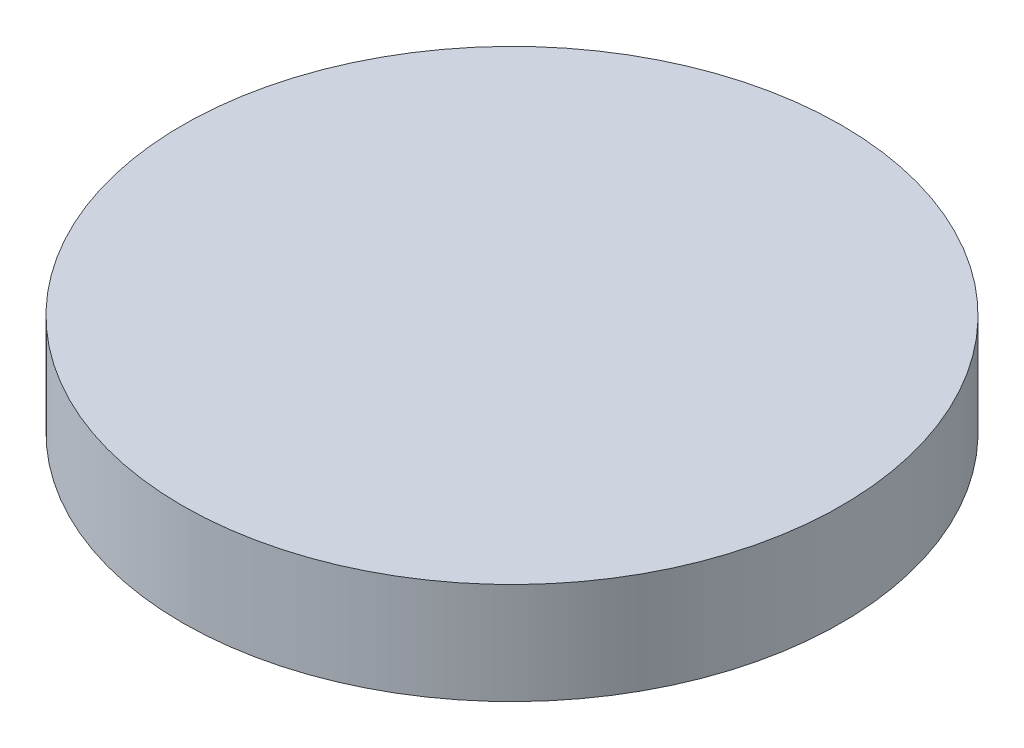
ISO-10303-21;
HEADER;
FILE_DESCRIPTION(('STEP AP214'),'2;1');
FILE_NAME('part.step','',(''),(''),'','','');
FILE_SCHEMA(('AUTOMOTIVE_DESIGN { 1 0 10303 214 1 1 1 1 }'));
ENDSEC;
DATA;
#1=APPLICATION_CONTEXT('core data for automotive mechanical design processes');
#2=APPLICATION_PROTOCOL_DEFINITION('international standard','automotive_design',2000,#1);
#3=PRODUCT_CONTEXT('',#1,'mechanical');
#4=PRODUCT('Part','Part','',(#3));
#5=PRODUCT_RELATED_PRODUCT_CATEGORY('part','',(#4));
#6=PRODUCT_DEFINITION_FORMATION('','',#4);
#7=PRODUCT_DEFINITION_CONTEXT('part definition',#1,'design');
#8=PRODUCT_DEFINITION('design','',#6,#7);
#9=PRODUCT_DEFINITION_SHAPE('','',#8);
#10=(LENGTH_UNIT() NAMED_UNIT(*) SI_UNIT(.MILLI.,.METRE.));
#11=(NAMED_UNIT(*) PLANE_ANGLE_UNIT() SI_UNIT($,.RADIAN.));
#12=(NAMED_UNIT(*) SI_UNIT($,.STERADIAN.) SOLID_ANGLE_UNIT());
#13=UNCERTAINTY_MEASURE_WITH_UNIT(LENGTH_MEASURE(1.E-05),#10,'distance_accuracy_value','');
#14=(GEOMETRIC_REPRESENTATION_CONTEXT(3) GLOBAL_UNCERTAINTY_ASSIGNED_CONTEXT((#13)) GLOBAL_UNIT_ASSIGNED_CONTEXT((#10,
#11,#12)) REPRESENTATION_CONTEXT('',''));
#15=CARTESIAN_POINT('',(0.,0.,0.));
#16=DIRECTION('',(0.,0.,1.));
#17=DIRECTION('',(1.,0.,0.));
#18=AXIS2_PLACEMENT_3D('',#15,#16,#17);
#19=CARTESIAN_POINT('',(0.,12.,0.));
#20=DIRECTION('',(0.,-1.,0.));
#21=DIRECTION('',(0.,0.,-1.));
#22=AXIS2_PLACEMENT_3D('',#19,#20,#21);
#23=CYLINDRICAL_SURFACE('',#22,39.);
#24=CARTESIAN_POINT('',(0.,12.,0.));
#25=DIRECTION('',(0.,1.,0.));
#26=DIRECTION('',(0.,0.,1.));
#27=AXIS2_PLACEMENT_3D('',#24,#25,#26);
#28=CIRCLE('',#27,39.);
#29=CARTESIAN_POINT('',(0.,12.,39.));
#30=VERTEX_POINT('',#29);
#31=EDGE_CURVE('E10',#30,#30,#28,.T.);
#32=ORIENTED_EDGE('',*,*,#31,.F.);
#33=EDGE_LOOP('',(#32));
#34=FACE_BOUND('',#33,.T.);
#35=CARTESIAN_POINT('',(0.,0.,0.));
#36=DIRECTION('',(0.,1.,0.));
#37=DIRECTION('',(0.,0.,1.));
#38=AXIS2_PLACEMENT_3D('',#35,#36,#37);
#39=CIRCLE('',#38,39.);
#40=CARTESIAN_POINT('',(0.,0.,39.));
#41=VERTEX_POINT('',#40);
#42=EDGE_CURVE('E34',#41,#41,#39,.T.);
#43=ORIENTED_EDGE('',*,*,#42,.T.);
#44=EDGE_LOOP('',(#43));
#45=FACE_BOUND('',#44,.T.);
#46=ADVANCED_FACE('F31',(#34,#45),#23,.T.);
#47=CARTESIAN_POINT('',(0.,12.,0.));
#48=DIRECTION('',(0.,1.,0.));
#49=DIRECTION('',(0.,0.,1.));
#50=AXIS2_PLACEMENT_3D('',#47,#48,#49);
#51=PLANE('',#50);
#52=ORIENTED_EDGE('',*,*,#31,.T.);
#53=EDGE_LOOP('',(#52));
#54=FACE_BOUND('',#53,.T.);
#55=ADVANCED_FACE('F46',(#54),#51,.T.);
#56=CARTESIAN_POINT('',(0.,0.,0.));
#57=DIRECTION('',(0.,1.,0.));
#58=DIRECTION('',(0.,0.,1.));
#59=AXIS2_PLACEMENT_3D('',#56,#57,#58);
#60=PLANE('',#59);
#61=ORIENTED_EDGE('',*,*,#42,.F.);
#62=EDGE_LOOP('',(#61));
#63=FACE_BOUND('',#62,.T.);
#64=ADVANCED_FACE('F44',(#63),#60,.F.);
#65=CLOSED_SHELL('',(#46,#55,#64));
#66=MANIFOLD_SOLID_BREP('B2',#65);
#67=ADVANCED_BREP_SHAPE_REPRESENTATION('',(#18,#66),#14);
#68=SHAPE_DEFINITION_REPRESENTATION(#9,#67);
ENDSEC;
END-ISO-10303-21;
